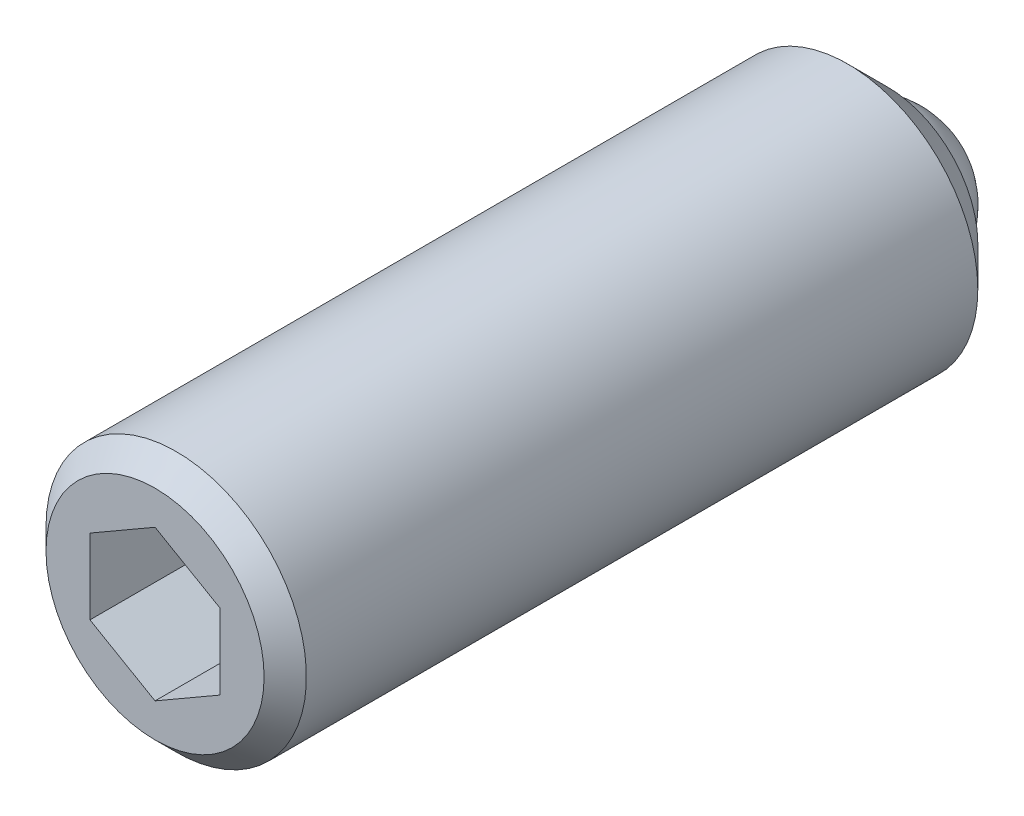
ISO-10303-21;
HEADER;
FILE_DESCRIPTION(('STEP AP214'),'2;1');
FILE_NAME('part.step','',(''),(''),'','','');
FILE_SCHEMA(('AUTOMOTIVE_DESIGN { 1 0 10303 214 1 1 1 1 }'));
ENDSEC;
DATA;
#1=APPLICATION_CONTEXT('core data for automotive mechanical design processes');
#2=APPLICATION_PROTOCOL_DEFINITION('international standard','automotive_design',2000,#1);
#3=PRODUCT_CONTEXT('',#1,'mechanical');
#4=PRODUCT('Part','Part','',(#3));
#5=PRODUCT_RELATED_PRODUCT_CATEGORY('part','',(#4));
#6=PRODUCT_DEFINITION_FORMATION('','',#4);
#7=PRODUCT_DEFINITION_CONTEXT('part definition',#1,'design');
#8=PRODUCT_DEFINITION('design','',#6,#7);
#9=PRODUCT_DEFINITION_SHAPE('','',#8);
#10=(LENGTH_UNIT() NAMED_UNIT(*) SI_UNIT(.MILLI.,.METRE.));
#11=(NAMED_UNIT(*) PLANE_ANGLE_UNIT() SI_UNIT($,.RADIAN.));
#12=(NAMED_UNIT(*) SI_UNIT($,.STERADIAN.) SOLID_ANGLE_UNIT());
#13=UNCERTAINTY_MEASURE_WITH_UNIT(LENGTH_MEASURE(1.E-05),#10,'distance_accuracy_value','');
#14=(GEOMETRIC_REPRESENTATION_CONTEXT(3) GLOBAL_UNCERTAINTY_ASSIGNED_CONTEXT((#13)) GLOBAL_UNIT_ASSIGNED_CONTEXT((#10,
#11,#12)) REPRESENTATION_CONTEXT('',''));
#15=CARTESIAN_POINT('',(0.,0.,0.));
#16=DIRECTION('',(0.,0.,1.));
#17=DIRECTION('',(1.,0.,0.));
#18=AXIS2_PLACEMENT_3D('',#15,#16,#17);
#19=CARTESIAN_POINT('',(1.99999999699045,5.77350269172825,42.5000000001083));
#20=DIRECTION('',(5.41266192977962E-11,0.,-1.));
#21=DIRECTION('',(0.500000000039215,-0.866025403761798,2.70619752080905E-11));
#22=AXIS2_PLACEMENT_3D('',#19,#20,#21);
#23=PLANE('',#22);
#24=DIRECTION('',(0.866025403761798,0.500000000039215,4.68757977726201E-11));
#25=VECTOR('',#24,1.);
#26=CARTESIAN_POINT('',(1.99999999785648,-3.46410161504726,42.5000000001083));
#27=LINE('',#26,#25);
#28=CARTESIAN_POINT('',(-2.40863188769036E-09,-4.61880215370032,42.5));
#29=VERTEX_POINT('',#28);
#30=CARTESIAN_POINT('',(3.9999999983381,-2.30940107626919,42.5000000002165));
#31=VERTEX_POINT('',#30);
#32=EDGE_CURVE('E109',#29,#31,#27,.T.);
#33=ORIENTED_EDGE('',*,*,#32,.T.);
#34=DIRECTION('',(0.,1.,0.));
#35=VECTOR('',#34,1.);
#36=CARTESIAN_POINT('',(3.99999999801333,3.62180120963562E-10,42.5000000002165));
#37=LINE('',#36,#35);
#38=CARTESIAN_POINT('',(3.99999999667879,2.30940107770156,42.5000000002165));
#39=VERTEX_POINT('',#38);
#40=EDGE_CURVE('E105',#31,#39,#37,.T.);
#41=ORIENTED_EDGE('',*,*,#40,.T.);
#42=DIRECTION('',(-0.866025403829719,0.499999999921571,-4.68742568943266E-11));
#43=VECTOR('',#42,1.);
#44=CARTESIAN_POINT('',(1.99999999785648,3.46410161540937,42.5000000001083));
#45=LINE('',#44,#43);
#46=CARTESIAN_POINT('',(-2.19213145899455E-09,4.61880215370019,42.5));
#47=VERTEX_POINT('',#46);
#48=EDGE_CURVE('E101',#39,#47,#45,.T.);
#49=ORIENTED_EDGE('',*,*,#48,.T.);
#50=DIRECTION('',(-0.866025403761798,-0.500000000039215,-4.68757977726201E-11));
#51=VECTOR('',#50,1.);
#52=CARTESIAN_POINT('',(-2.00000000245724,3.46410161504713,42.4999999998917));
#53=LINE('',#52,#51);
#54=CARTESIAN_POINT('',(-4.00000000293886,2.30940107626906,42.4999999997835));
#55=VERTEX_POINT('',#54);
#56=EDGE_CURVE('E46',#47,#55,#53,.T.);
#57=ORIENTED_EDGE('',*,*,#56,.T.);
#58=DIRECTION('',(0.,-1.,0.));
#59=VECTOR('',#58,1.);
#60=CARTESIAN_POINT('',(-4.00000000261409,-3.62316079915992E-10,42.4999999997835));
#61=LINE('',#60,#59);
#62=CARTESIAN_POINT('',(-4.00000000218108,-2.3094010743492,42.4999999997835));
#63=VERTEX_POINT('',#62);
#64=EDGE_CURVE('E83',#55,#63,#61,.T.);
#65=ORIENTED_EDGE('',*,*,#64,.T.);
#66=DIRECTION('',(0.866025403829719,-0.499999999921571,4.68742568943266E-11));
#67=VECTOR('',#66,1.);
#68=CARTESIAN_POINT('',(-2.00000000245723,-3.46410161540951,42.4999999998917));
#69=LINE('',#68,#67);
#70=EDGE_CURVE('E31',#63,#29,#69,.T.);
#71=ORIENTED_EDGE('',*,*,#70,.T.);
#72=EDGE_LOOP('',(#33,#41,#49,#57,#65,#71));
#73=FACE_BOUND('',#72,.T.);
#74=ADVANCED_FACE('F14',(#73),#23,.F.);
#75=CARTESIAN_POINT('',(-2.62513795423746E-09,-4.61880215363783,48.5));
#76=DIRECTION('',(-0.499999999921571,-0.866025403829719,-2.70646440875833E-11));
#77=DIRECTION('',(-0.866025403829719,0.499999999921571,-4.68742568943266E-11));
#78=AXIS2_PLACEMENT_3D('',#75,#76,#77);
#79=PLANE('',#78);
#80=ORIENTED_EDGE('',*,*,#70,.F.);
#81=DIRECTION('',(-5.41266192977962E-11,0.,1.));
#82=VECTOR('',#81,1.);
#83=CARTESIAN_POINT('',(-4.00000000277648,-2.3094010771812,45.4999999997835));
#84=LINE('',#83,#82);
#85=CARTESIAN_POINT('',(-4.00000000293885,-2.3094010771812,48.4999999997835));
#86=VERTEX_POINT('',#85);
#87=EDGE_CURVE('E115',#63,#86,#84,.T.);
#88=ORIENTED_EDGE('',*,*,#87,.T.);
#89=DIRECTION('',(-0.866025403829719,0.499999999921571,-4.68742568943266E-11));
#90=VECTOR('',#89,1.);
#91=CARTESIAN_POINT('',(-2.62513795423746E-09,-4.61880215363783,48.5));
#92=LINE('',#91,#90);
#93=CARTESIAN_POINT('',(-4.95389883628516E-09,-4.61880215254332,48.5));
#94=VERTEX_POINT('',#93);
#95=EDGE_CURVE('E60',#86,#94,#92,.F.);
#96=ORIENTED_EDGE('',*,*,#95,.T.);
#97=DIRECTION('',(5.41266192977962E-11,0.,-1.));
#98=VECTOR('',#97,1.);
#99=CARTESIAN_POINT('',(-3.32878386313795E-09,-4.61880215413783,45.5));
#100=LINE('',#99,#98);
#101=EDGE_CURVE('E108',#94,#29,#100,.T.);
#102=ORIENTED_EDGE('',*,*,#101,.T.);
#103=EDGE_LOOP('',(#80,#88,#96,#102));
#104=FACE_BOUND('',#103,.T.);
#105=ADVANCED_FACE('F162',(#104),#79,.F.);
#106=CARTESIAN_POINT('',(3.9999999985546,-2.30940107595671,48.5000000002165));
#107=DIRECTION('',(0.500000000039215,-0.866025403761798,2.70619752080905E-11));
#108=DIRECTION('',(-0.866025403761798,-0.500000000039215,-4.68757977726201E-11));
#109=AXIS2_PLACEMENT_3D('',#106,#107,#108);
#110=PLANE('',#109);
#111=ORIENTED_EDGE('',*,*,#32,.F.);
#112=ORIENTED_EDGE('',*,*,#101,.F.);
#113=DIRECTION('',(0.866025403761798,0.500000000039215,4.68757977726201E-11));
#114=VECTOR('',#113,1.);
#115=CARTESIAN_POINT('',(1.99999999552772,-3.46410161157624,48.5000000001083));
#116=LINE('',#115,#114);
#117=CARTESIAN_POINT('',(3.99999999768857,-2.30940107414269,48.5000000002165));
#118=VERTEX_POINT('',#117);
#119=EDGE_CURVE('E175',#94,#118,#116,.T.);
#120=ORIENTED_EDGE('',*,*,#119,.T.);
#121=DIRECTION('',(5.41266192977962E-11,0.,-1.));
#122=VECTOR('',#121,1.);
#123=CARTESIAN_POINT('',(3.99999999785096,-2.3094010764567,45.5000000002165));
#124=LINE('',#123,#122);
#125=EDGE_CURVE('E98',#118,#31,#124,.T.);
#126=ORIENTED_EDGE('',*,*,#125,.T.);
#127=EDGE_LOOP('',(#111,#112,#120,#126));
#128=FACE_BOUND('',#127,.T.);
#129=ADVANCED_FACE('F158',(#128),#110,.F.);
#130=CARTESIAN_POINT('',(3.99999999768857,2.30940107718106,48.5000000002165));
#131=DIRECTION('',(1.,0.,5.4126619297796E-11));
#132=DIRECTION('',(0.,-1.,0.));
#133=AXIS2_PLACEMENT_3D('',#130,#131,#132);
#134=PLANE('',#133);
#135=ORIENTED_EDGE('',*,*,#40,.F.);
#136=ORIENTED_EDGE('',*,*,#125,.F.);
#137=DIRECTION('',(0.,-1.,0.));
#138=VECTOR('',#137,1.);
#139=CARTESIAN_POINT('',(3.99999999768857,2.30940107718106,48.5000000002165));
#140=LINE('',#139,#138);
#141=CARTESIAN_POINT('',(3.99999999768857,2.30940107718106,48.5000000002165));
#142=VERTEX_POINT('',#141);
#143=EDGE_CURVE('E94',#118,#142,#140,.F.);
#144=ORIENTED_EDGE('',*,*,#143,.T.);
#145=DIRECTION('',(5.41266192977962E-11,0.,-1.));
#146=VECTOR('',#145,1.);
#147=CARTESIAN_POINT('',(3.99999999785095,2.30940107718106,45.5000000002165));
#148=LINE('',#147,#146);
#149=EDGE_CURVE('E102',#142,#39,#148,.T.);
#150=ORIENTED_EDGE('',*,*,#149,.T.);
#151=EDGE_LOOP('',(#135,#136,#144,#150));
#152=FACE_BOUND('',#151,.T.);
#153=ADVANCED_FACE('F154',(#152),#134,.F.);
#154=CARTESIAN_POINT('',(-2.62514662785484E-09,4.61880215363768,48.5));
#155=DIRECTION('',(0.499999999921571,0.866025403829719,2.70646440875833E-11));
#156=DIRECTION('',(0.866025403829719,-0.499999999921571,4.68742568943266E-11));
#157=AXIS2_PLACEMENT_3D('',#154,#155,#156);
#158=PLANE('',#157);
#159=ORIENTED_EDGE('',*,*,#48,.F.);
#160=ORIENTED_EDGE('',*,*,#149,.F.);
#161=DIRECTION('',(0.866025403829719,-0.499999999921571,4.68742568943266E-11));
#162=VECTOR('',#161,1.);
#163=CARTESIAN_POINT('',(-2.62514662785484E-09,4.61880215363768,48.5));
#164=LINE('',#163,#162);
#165=CARTESIAN_POINT('',(-2.96386179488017E-10,4.61880215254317,48.5));
#166=VERTEX_POINT('',#165);
#167=EDGE_CURVE('E92',#142,#166,#164,.F.);
#168=ORIENTED_EDGE('',*,*,#167,.T.);
#169=DIRECTION('',(5.41266192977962E-11,0.,-1.));
#170=VECTOR('',#169,1.);
#171=CARTESIAN_POINT('',(-1.59673923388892E-09,4.61880215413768,45.5));
#172=LINE('',#171,#170);
#173=EDGE_CURVE('E74',#166,#47,#172,.T.);
#174=ORIENTED_EDGE('',*,*,#173,.T.);
#175=EDGE_LOOP('',(#159,#160,#168,#174));
#176=FACE_BOUND('',#175,.T.);
#177=ADVANCED_FACE('F151',(#176),#158,.F.);
#178=CARTESIAN_POINT('',(-4.00000000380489,2.30940107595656,48.4999999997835));
#179=DIRECTION('',(-0.500000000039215,0.866025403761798,-2.70619752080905E-11));
#180=DIRECTION('',(0.866025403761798,0.500000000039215,4.68757977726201E-11));
#181=AXIS2_PLACEMENT_3D('',#178,#179,#180);
#182=PLANE('',#181);
#183=ORIENTED_EDGE('',*,*,#56,.F.);
#184=ORIENTED_EDGE('',*,*,#173,.F.);
#185=DIRECTION('',(-0.866025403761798,-0.500000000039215,-4.68757977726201E-11));
#186=VECTOR('',#185,1.);
#187=CARTESIAN_POINT('',(-2.000000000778,3.46410161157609,48.4999999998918));
#188=LINE('',#187,#186);
#189=CARTESIAN_POINT('',(-4.00000000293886,2.30940107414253,48.4999999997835));
#190=VERTEX_POINT('',#189);
#191=EDGE_CURVE('E87',#166,#190,#188,.T.);
#192=ORIENTED_EDGE('',*,*,#191,.T.);
#193=DIRECTION('',(5.41266192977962E-11,0.,-1.));
#194=VECTOR('',#193,1.);
#195=CARTESIAN_POINT('',(-4.00000000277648,2.30940107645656,45.4999999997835));
#196=LINE('',#195,#194);
#197=EDGE_CURVE('E80',#190,#55,#196,.T.);
#198=ORIENTED_EDGE('',*,*,#197,.T.);
#199=EDGE_LOOP('',(#183,#184,#192,#198));
#200=FACE_BOUND('',#199,.T.);
#201=ADVANCED_FACE('F91',(#200),#182,.F.);
#202=CARTESIAN_POINT('',(-4.00000000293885,-2.3094010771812,48.4999999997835));
#203=DIRECTION('',(-1.,0.,-5.4126619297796E-11));
#204=DIRECTION('',(0.,1.,0.));
#205=AXIS2_PLACEMENT_3D('',#202,#203,#204);
#206=PLANE('',#205);
#207=ORIENTED_EDGE('',*,*,#64,.F.);
#208=ORIENTED_EDGE('',*,*,#197,.F.);
#209=DIRECTION('',(0.,1.,0.));
#210=VECTOR('',#209,1.);
#211=CARTESIAN_POINT('',(-4.00000000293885,-2.3094010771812,48.4999999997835));
#212=LINE('',#211,#210);
#213=EDGE_CURVE('E82',#190,#86,#212,.F.);
#214=ORIENTED_EDGE('',*,*,#213,.T.);
#215=ORIENTED_EDGE('',*,*,#87,.F.);
#216=EDGE_LOOP('',(#207,#208,#214,#215));
#217=FACE_BOUND('',#216,.T.);
#218=ADVANCED_FACE('F81',(#217),#206,.F.);
#219=CARTESIAN_POINT('',(2.40771510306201,8.98571510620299,48.5000000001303));
#220=DIRECTION('',(5.41266192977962E-11,0.,-1.));
#221=DIRECTION('',(0.500000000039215,-0.866025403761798,2.70619752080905E-11));
#222=AXIS2_PLACEMENT_3D('',#219,#220,#221);
#223=PLANE('',#222);
#224=CARTESIAN_POINT('',(0.,0.,48.5));
#225=DIRECTION('',(5.41266192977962E-11,0.,-1.));
#226=DIRECTION('',(-1.,0.,-5.41266192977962E-11));
#227=AXIS2_PLACEMENT_3D('',#224,#225,#226);
#228=CIRCLE('',#227,6.69999999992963);
#229=CARTESIAN_POINT('',(-6.69999999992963,0.,48.4999999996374));
#230=VERTEX_POINT('',#229);
#231=EDGE_CURVE('E9',#230,#230,#228,.F.);
#232=ORIENTED_EDGE('',*,*,#231,.T.);
#233=EDGE_LOOP('',(#232));
#234=FACE_BOUND('',#233,.T.);
#235=ORIENTED_EDGE('',*,*,#191,.F.);
#236=ORIENTED_EDGE('',*,*,#167,.F.);
#237=ORIENTED_EDGE('',*,*,#143,.F.);
#238=ORIENTED_EDGE('',*,*,#119,.F.);
#239=ORIENTED_EDGE('',*,*,#95,.F.);
#240=ORIENTED_EDGE('',*,*,#213,.F.);
#241=EDGE_LOOP('',(#235,#236,#237,#238,#239,#240));
#242=FACE_BOUND('',#241,.T.);
#243=ADVANCED_FACE('F85',(#234,#242),#223,.F.);
#244=CARTESIAN_POINT('',(0.,0.,-2.76364517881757));
#245=DIRECTION('',(0.,0.,-1.));
#246=DIRECTION('',(-1.,0.,0.));
#247=AXIS2_PLACEMENT_3D('',#244,#245,#246);
#248=CYLINDRICAL_SURFACE('',#247,8.);
#249=CARTESIAN_POINT('',(0.,0.,47.1999999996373));
#250=DIRECTION('',(0.,0.,-1.));
#251=DIRECTION('',(-1.,0.,0.));
#252=AXIS2_PLACEMENT_3D('',#249,#250,#251);
#253=CIRCLE('',#252,8.);
#254=CARTESIAN_POINT('',(-8.,0.,47.1999999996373));
#255=VERTEX_POINT('',#254);
#256=EDGE_CURVE('E23',#255,#255,#253,.T.);
#257=ORIENTED_EDGE('',*,*,#256,.T.);
#258=EDGE_LOOP('',(#257));
#259=FACE_BOUND('',#258,.T.);
#260=CARTESIAN_POINT('',(0.,0.,5.94999999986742));
#261=DIRECTION('',(0.,0.,1.));
#262=DIRECTION('',(1.,0.,0.));
#263=AXIS2_PLACEMENT_3D('',#260,#261,#262);
#264=CIRCLE('',#263,8.);
#265=CARTESIAN_POINT('',(8.,0.,5.94999999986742));
#266=VERTEX_POINT('',#265);
#267=EDGE_CURVE('E118',#266,#266,#264,.T.);
#268=ORIENTED_EDGE('',*,*,#267,.T.);
#269=EDGE_LOOP('',(#268));
#270=FACE_BOUND('',#269,.T.);
#271=ADVANCED_FACE('F123',(#259,#270),#248,.T.);
#272=CARTESIAN_POINT('',(7.67241828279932,-2.05581828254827,3.50000000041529));
#273=DIRECTION('',(-5.41266192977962E-11,0.,1.));
#274=DIRECTION('',(-0.500000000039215,0.866025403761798,-2.70619752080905E-11));
#275=AXIS2_PLACEMENT_3D('',#272,#273,#274);
#276=PLANE('',#275);
#277=CARTESIAN_POINT('',(0.,0.,3.5));
#278=DIRECTION('',(-5.41266192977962E-11,0.,1.));
#279=DIRECTION('',(1.,0.,5.41266192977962E-11));
#280=AXIS2_PLACEMENT_3D('',#277,#278,#279);
#281=CIRCLE('',#280,5.5499999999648);
#282=CARTESIAN_POINT('',(5.5499999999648,0.,3.5000000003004));
#283=VERTEX_POINT('',#282);
#284=EDGE_CURVE('E107',#283,#283,#281,.F.);
#285=ORIENTED_EDGE('',*,*,#284,.T.);
#286=EDGE_LOOP('',(#285));
#287=FACE_BOUND('',#286,.T.);
#288=CARTESIAN_POINT('',(0.,0.,3.49999999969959));
#289=DIRECTION('',(0.,0.,-1.));
#290=DIRECTION('',(-1.,0.,0.));
#291=AXIS2_PLACEMENT_3D('',#288,#289,#290);
#292=CIRCLE('',#291,4.76969600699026);
#293=CARTESIAN_POINT('',(-4.76969600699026,0.,3.49999999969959));
#294=VERTEX_POINT('',#293);
#295=EDGE_CURVE('E89',#294,#294,#292,.T.);
#296=ORIENTED_EDGE('',*,*,#295,.F.);
#297=EDGE_LOOP('',(#296));
#298=FACE_BOUND('',#297,.T.);
#299=ADVANCED_FACE('F143',(#287,#298),#276,.F.);
#300=CARTESIAN_POINT('',(0.,0.,5.));
#301=DIRECTION('',(0.,0.,-1.));
#302=DIRECTION('',(-1.,0.,0.));
#303=AXIS2_PLACEMENT_3D('',#300,#301,#302);
#304=SPHERICAL_SURFACE('',#303,5.);
#305=ORIENTED_EDGE('',*,*,#295,.T.);
#306=EDGE_LOOP('',(#305));
#307=FACE_BOUND('',#306,.T.);
#308=ADVANCED_FACE('F133',(#307),#304,.T.);
#309=CARTESIAN_POINT('',(0.,0.,3.5));
#310=DIRECTION('',(0.,0.,1.));
#311=DIRECTION('',(1.,0.,0.));
#312=AXIS2_PLACEMENT_3D('',#309,#310,#311);
#313=CONICAL_SURFACE('',#312,5.55000000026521,0.785398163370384);
#314=ORIENTED_EDGE('',*,*,#267,.F.);
#315=EDGE_LOOP('',(#314));
#316=FACE_BOUND('',#315,.T.);
#317=ORIENTED_EDGE('',*,*,#284,.F.);
#318=EDGE_LOOP('',(#317));
#319=FACE_BOUND('',#318,.T.);
#320=ADVANCED_FACE('F127',(#316,#319),#313,.T.);
#321=CARTESIAN_POINT('',(0.,0.,47.1999999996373));
#322=DIRECTION('',(0.,0.,-1.));
#323=DIRECTION('',(-1.,0.,0.));
#324=AXIS2_PLACEMENT_3D('',#321,#322,#323);
#325=CONICAL_SURFACE('',#324,8.,0.785398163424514);
#326=ORIENTED_EDGE('',*,*,#231,.F.);
#327=EDGE_LOOP('',(#326));
#328=FACE_BOUND('',#327,.T.);
#329=ORIENTED_EDGE('',*,*,#256,.F.);
#330=EDGE_LOOP('',(#329));
#331=FACE_BOUND('',#330,.T.);
#332=ADVANCED_FACE('F16',(#328,#331),#325,.T.);
#333=CLOSED_SHELL('',(#74,#105,#129,#153,#177,#201,#218,#243,#271,#299,#308,#320,#332));
#334=MANIFOLD_SOLID_BREP('B1',#333);
#335=ADVANCED_BREP_SHAPE_REPRESENTATION('',(#18,#334),#14);
#336=SHAPE_DEFINITION_REPRESENTATION(#9,#335);
ENDSEC;
END-ISO-10303-21;
